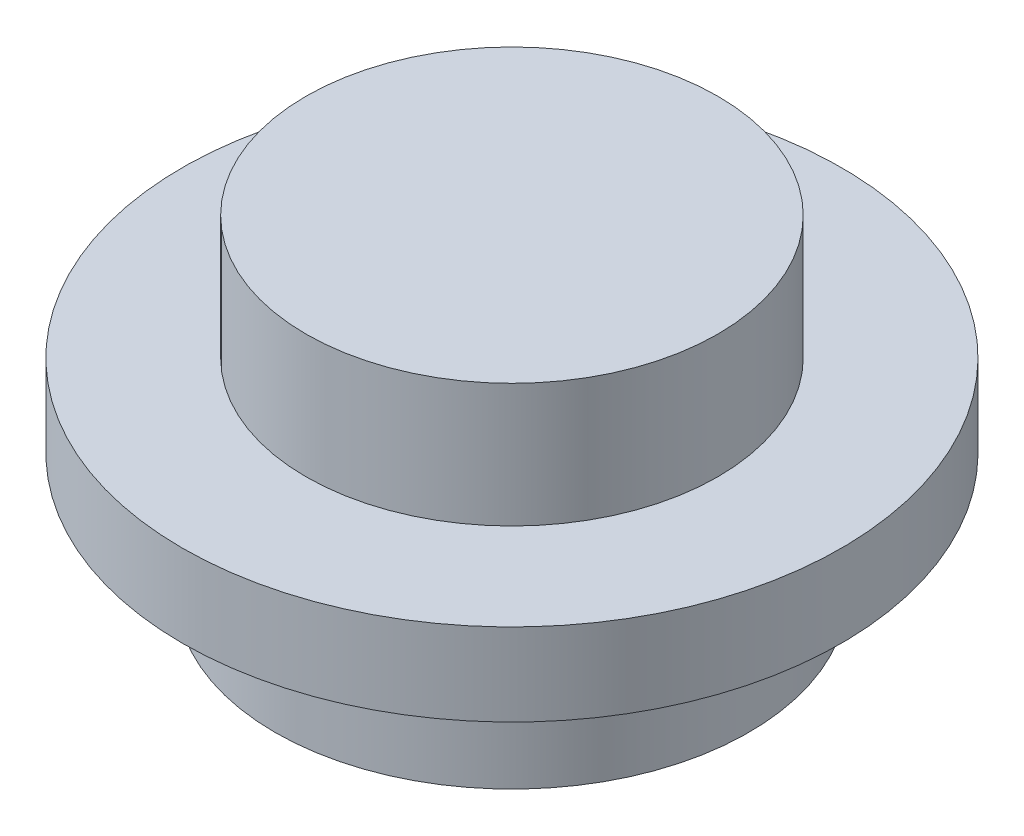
from build123d import *

# Parameters (mm, degrees)
ESQUISSE1_R      = 2.875
ESQUISSE1_R_2    = 2.5
EXTRUSION1_DEPTH = 1.5
ESQUISSE2_R      = 4
EXTRUSION2_DEPTH = 1
ESQUISSE3_R      = 2.5
EXTRUSION3_DEPTH = 1.5


with BuildPart() as part:
    # Esquisse1 → Extrusion1 (new body)
    with BuildSketch(Plane(origin=(0, 0, 0), x_dir=(1, 0, 0), z_dir=(0, 1, 0))):
        with Locations(Location((0, 0, 0), (0, 0, 270))):
            Circle(ESQUISSE1_R)
        with Locations(Location((0, 0, 0), (0, 0, 270))):
            Circle(ESQUISSE1_R_2, mode=Mode.SUBTRACT)
    extrude(amount=EXTRUSION1_DEPTH)

    # Esquisse2 → Extrusion2 (add)
    with BuildSketch(Plane(origin=(0, 1.5, 0), x_dir=(-1, 0, 0), z_dir=(0, 1, 0))):
        with Locations(Location((0, 0, 0), (0, 0, 90))):
            Circle(ESQUISSE2_R)
    extrude(amount=EXTRUSION2_DEPTH)

    # Esquisse3 → Extrusion3 (add)
    with BuildSketch(Plane(origin=(0, 2.5, 0), x_dir=(-1, 0, 0), z_dir=(0, 1, 0))):
        with Locations(Location((0, 0, 0), (0, 0, 90))):
            Circle(ESQUISSE3_R)
    extrude(amount=EXTRUSION3_DEPTH)


solid = part.part
